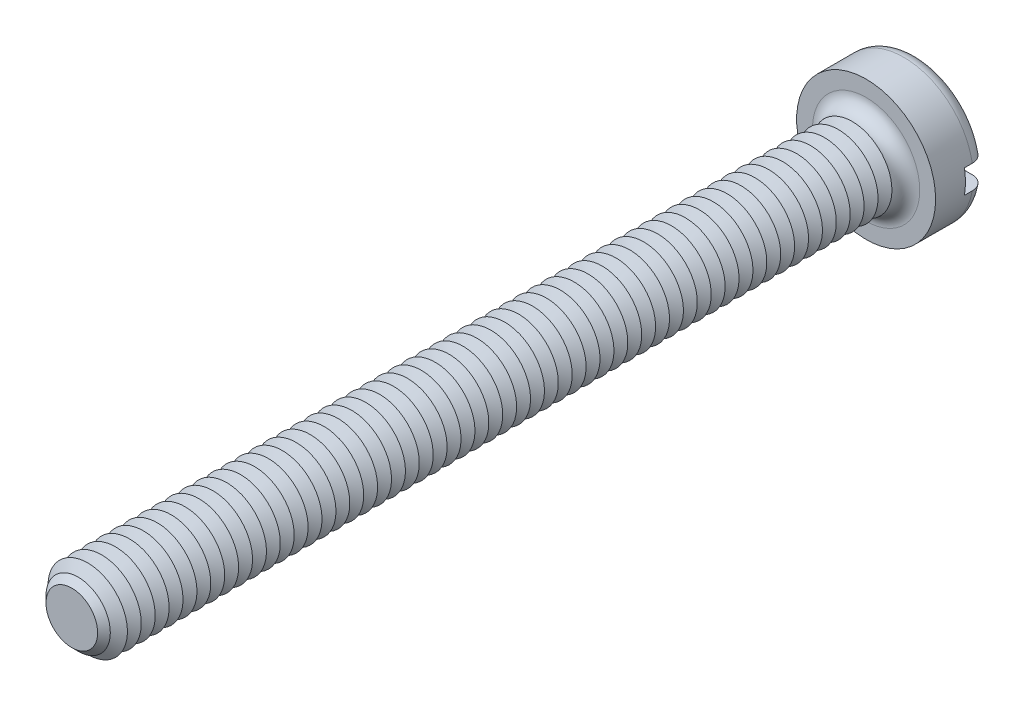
from build123d import *

# Parameters (mm, degrees)
SKETCH3_R           = 3.5
BOSS_EXTRUDE2_DEPTH = 2.6
SKETCH4_R           = 2
BOSS_EXTRUDE3_DEPTH = 40
FILLET1_R           = 0.7
CHAMFER1_SIZE       = 0.7
LPATTERN1_COUNT     = 56
LPATTERN1_PITCH     = 0.7
SKETCH8_W           = 7
SKETCH8_H           = 1.2
CUT_EXTRUDE1_DEPTH  = 1.1


with BuildPart() as part:
    # Sketch3 → Boss-Extrude2 (new body)
    with BuildSketch(Plane.XY):
        Circle(SKETCH3_R)
    extrude(amount=-BOSS_EXTRUDE2_DEPTH)

    # Sketch4 → Boss-Extrude3 (add)
    with BuildSketch(Plane.XY):
        Circle(SKETCH4_R)
    extrude(amount=BOSS_EXTRUDE3_DEPTH)

    # Fillet1
    fillet1_edges = [part.edges().sort_by_distance(p)[0] for p in [
        (-3.5, 0, -2.6),
        (-2, 0, 0),
    ]]
    fillet(fillet1_edges, radius=FILLET1_R)

    # Chamfer1
    chamfer1_edges = [part.edges().sort_by_distance(p)[0] for p in [
        (-2, 0, 40),
    ]]
    chamfer(chamfer1_edges, length=CHAMFER1_SIZE)

    # Sketch6 → Cut-Revolve1 (revolve, cut)
    with BuildSketch(Plane(origin=(0, 0, 0), x_dir=(0, 0, -1), z_dir=(1, 0, 0)), mode=Mode.PRIVATE) as cut_revolve1_sk:
        Polygon((-0.7, 2), (-1.05, 1.393782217), (-1.4, 2), align=None)
    cut_revolve1 = revolve(cut_revolve1_sk.sketch.rotate(Axis((0, 0, -1.694361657), (0, 0, 1)), 90), axis=Axis((0, 0, -1.694361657), (0, 0, 1)), mode=Mode.SUBTRACT)

    # LPattern1: Cut-Revolve1 ×56
    with Locations(*[(0, 0, i * LPATTERN1_PITCH) for i in range(1, LPATTERN1_COUNT)]):
        add(cut_revolve1, mode=Mode.SUBTRACT)

    # Sketch8 → Cut-Extrude1 (cut)
    with BuildSketch(Plane(origin=(0, 0, -2.6), x_dir=(-1, 0, 0), z_dir=(0, 0, -1))):
        Rectangle(SKETCH8_W, SKETCH8_H)
    extrude(amount=-CUT_EXTRUDE1_DEPTH, mode=Mode.SUBTRACT)


solid = part.part
